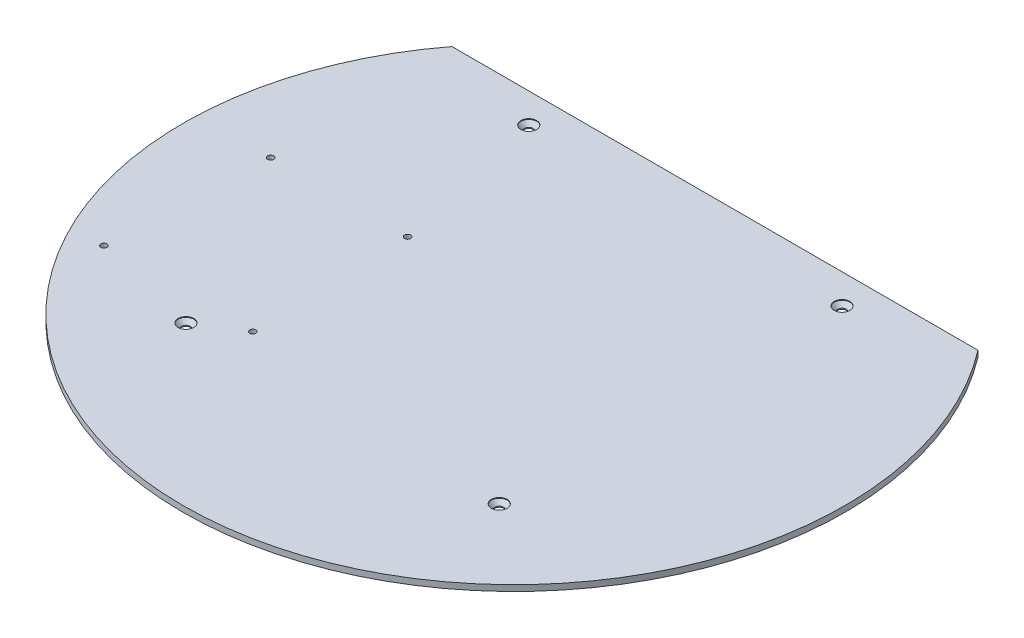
from build123d import *

# Parameters (mm, degrees)
EXTRUDE1_DEPTH                                = 3.175
CSK_FOR_8_FLAT_HEAD_MACHINE_SCREW1_AT_2_COUNT = 2
CSK_FOR_8_FLAT_HEAD_MACHINE_SCREW1_AT_2_PITCH = 168.275
CSK_FOR_8_FLAT_HEAD_MACHINE_SCREW1_AT_3_COUNT = 2
CSK_FOR_8_FLAT_HEAD_MACHINE_SCREW1_AT_3_PITCH = 249.454801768
CSK_FOR_8_FLAT_HEAD_MACHINE_SCREW1_AT_4_COUNT = 2
CSK_FOR_8_FLAT_HEAD_MACHINE_SCREW1_AT_4_PITCH = 184.15
SKETCH4_R                                     = 1.651
PC104_PATTERN_DEPTH                           = 414.943168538


with BuildPart() as part:
    # Sketch1 → Extrude1 (new body)
    with BuildSketch(Plane(origin=(0, 0, 0), x_dir=(1, 0, 0), z_dir=(0, 1, 0))):
        with BuildLine():
            Line((141.278581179, 107.95), (-141.278581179, 107.95))
            ThreePointArc((-141.278581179, 107.95), (0, -177.8), (141.278581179, 107.95))
        make_face()
    extrude(amount=EXTRUDE1_DEPTH)

    # Sketch5 → CSK for _8 Flat Head Machine Screw1 (revolve, cut)
    with BuildSketch(Plane(origin=(-84.1375, 3.175, -92.075), x_dir=(0, 0, 1), z_dir=(1, 0, 0))):
        Polygon((0, 0), (0, 3.175), (2.2479, 3.175), (2.2479, 2.64550021), (4.2164, 0.381), (4.2164, 0), align=None)
    csk_for_8_flat_head_machine_screw1 = revolve(axis=Axis((-84.1375, 9.525, -92.075), (0, -1, 0)), mode=Mode.SUBTRACT)

    # CSK for _8 Flat Head Machine Screw1 at 2: CSK for _8 Flat Head Machine Screw1 ×2
    with Locations(*[(i * CSK_FOR_8_FLAT_HEAD_MACHINE_SCREW1_AT_2_PITCH, 0, 0) for i in range(1, CSK_FOR_8_FLAT_HEAD_MACHINE_SCREW1_AT_2_COUNT)]):
        add(csk_for_8_flat_head_machine_screw1, mode=Mode.SUBTRACT)

    # CSK for _8 Flat Head Machine Screw1 at 3: CSK for _8 Flat Head Machine Screw1 ×2
    with Locations(*[Vector(0.6745710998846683, 0, 0.738209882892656) * (i * CSK_FOR_8_FLAT_HEAD_MACHINE_SCREW1_AT_3_PITCH) for i in range(1, CSK_FOR_8_FLAT_HEAD_MACHINE_SCREW1_AT_3_COUNT)]):
        add(csk_for_8_flat_head_machine_screw1, mode=Mode.SUBTRACT)

    # CSK for _8 Flat Head Machine Screw1 at 4: CSK for _8 Flat Head Machine Screw1 ×2
    with Locations(*[(0, 0, i * CSK_FOR_8_FLAT_HEAD_MACHINE_SCREW1_AT_4_PITCH) for i in range(1, CSK_FOR_8_FLAT_HEAD_MACHINE_SCREW1_AT_4_COUNT)]):
        add(csk_for_8_flat_head_machine_screw1, mode=Mode.SUBTRACT)

    # Sketch4 → PC104 Pattern (cut, through all)
    with BuildSketch(Plane(origin=(-209.095442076, 3.175, 39.192050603), x_dir=(1, 0, 0), z_dir=(0, 1, 0))):
        with Locations(Location((66.951187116, -38.946436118, 0), (0, 0, 180))):
            Circle(SKETCH4_R)
        with Locations(Location((146.961187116, -38.946436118, 0), (0, 0, 180))):
            Circle(SKETCH4_R)
        with Locations(Location((70.761187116, 46.778563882, 0), (0, 0, 180))):
            Circle(SKETCH4_R)
        with Locations(Location((144.421187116, 46.778563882, 0), (0, 0, 180))):
            Circle(SKETCH4_R)
    extrude(amount=-PC104_PATTERN_DEPTH, mode=Mode.SUBTRACT)


solid = part.part
